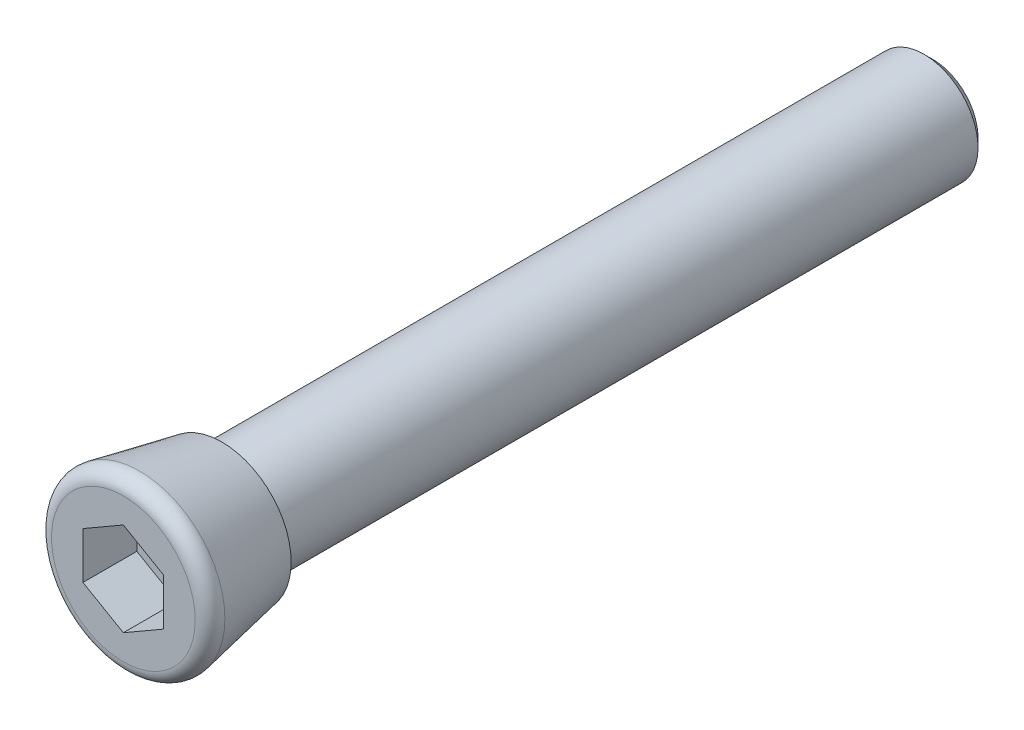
ISO-10303-21;
HEADER;
FILE_DESCRIPTION(('STEP AP214'),'2;1');
FILE_NAME('part.step','',(''),(''),'','','');
FILE_SCHEMA(('AUTOMOTIVE_DESIGN { 1 0 10303 214 1 1 1 1 }'));
ENDSEC;
DATA;
#1=APPLICATION_CONTEXT('core data for automotive mechanical design processes');
#2=APPLICATION_PROTOCOL_DEFINITION('international standard','automotive_design',2000,#1);
#3=PRODUCT_CONTEXT('',#1,'mechanical');
#4=PRODUCT('Part','Part','',(#3));
#5=PRODUCT_RELATED_PRODUCT_CATEGORY('part','',(#4));
#6=PRODUCT_DEFINITION_FORMATION('','',#4);
#7=PRODUCT_DEFINITION_CONTEXT('part definition',#1,'design');
#8=PRODUCT_DEFINITION('design','',#6,#7);
#9=PRODUCT_DEFINITION_SHAPE('','',#8);
#10=(LENGTH_UNIT() NAMED_UNIT(*) SI_UNIT(.MILLI.,.METRE.));
#11=(NAMED_UNIT(*) PLANE_ANGLE_UNIT() SI_UNIT($,.RADIAN.));
#12=(NAMED_UNIT(*) SI_UNIT($,.STERADIAN.) SOLID_ANGLE_UNIT());
#13=UNCERTAINTY_MEASURE_WITH_UNIT(LENGTH_MEASURE(1.E-05),#10,'distance_accuracy_value','');
#14=(GEOMETRIC_REPRESENTATION_CONTEXT(3) GLOBAL_UNCERTAINTY_ASSIGNED_CONTEXT((#13)) GLOBAL_UNIT_ASSIGNED_CONTEXT((#10,
#11,#12)) REPRESENTATION_CONTEXT('',''));
#15=CARTESIAN_POINT('',(0.,0.,0.));
#16=DIRECTION('',(0.,0.,1.));
#17=DIRECTION('',(1.,0.,0.));
#18=AXIS2_PLACEMENT_3D('',#15,#16,#17);
#19=CARTESIAN_POINT('',(-0.945872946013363,0.5461,-1.8288));
#20=DIRECTION('',(0.,0.,-1.));
#21=DIRECTION('',(-0.5,-0.866025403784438,0.));
#22=AXIS2_PLACEMENT_3D('',#19,#20,#21);
#23=PLANE('',#22);
#24=CARTESIAN_POINT('',(0.,0.,-1.8288));
#25=DIRECTION('',(0.,0.,-1.));
#26=DIRECTION('',(-0.5,-0.866025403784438,0.));
#27=AXIS2_PLACEMENT_3D('',#24,#25,#26);
#28=CIRCLE('',#27,1.28614392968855);
#29=CARTESIAN_POINT('',(-0.643071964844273,-1.11383331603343,-1.8288));
#30=VERTEX_POINT('',#29);
#31=EDGE_CURVE('E23',#30,#30,#28,.T.);
#32=ORIENTED_EDGE('',*,*,#31,.T.);
#33=EDGE_LOOP('',(#32));
#34=FACE_BOUND('',#33,.T.);
#35=CARTESIAN_POINT('',(0.,0.,-1.8288));
#36=DIRECTION('',(0.,0.,-1.));
#37=DIRECTION('',(-0.5,-0.866025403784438,0.));
#38=AXIS2_PLACEMENT_3D('',#35,#36,#37);
#39=CIRCLE('',#38,1.0922);
#40=CARTESIAN_POINT('',(-0.5461,-0.945872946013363,-1.8288));
#41=VERTEX_POINT('',#40);
#42=EDGE_CURVE('E130',#41,#41,#39,.T.);
#43=ORIENTED_EDGE('',*,*,#42,.F.);
#44=EDGE_LOOP('',(#43));
#45=FACE_BOUND('',#44,.T.);
#46=ADVANCED_FACE('F14',(#34,#45),#23,.T.);
#47=CARTESIAN_POINT('',(0.,0.,-1.8288));
#48=DIRECTION('',(0.,0.,1.));
#49=DIRECTION('',(0.5,0.866025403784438,0.));
#50=AXIS2_PLACEMENT_3D('',#47,#48,#49);
#51=CONICAL_SURFACE('',#50,1.28614392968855,0.191986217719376);
#52=CARTESIAN_POINT('',(0.,0.,-0.302465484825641));
#53=DIRECTION('',(0.,0.,-1.));
#54=DIRECTION('',(-0.5,-0.866025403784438,0.));
#55=AXIS2_PLACEMENT_3D('',#52,#53,#54);
#56=CIRCLE('',#55,1.5828333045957);
#57=CARTESIAN_POINT('',(-0.791416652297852,-1.37077385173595,-0.302465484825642));
#58=VERTEX_POINT('',#57);
#59=EDGE_CURVE('E136',#58,#58,#56,.T.);
#60=ORIENTED_EDGE('',*,*,#59,.T.);
#61=EDGE_LOOP('',(#60));
#62=FACE_BOUND('',#61,.T.);
#63=ORIENTED_EDGE('',*,*,#31,.F.);
#64=EDGE_LOOP('',(#63));
#65=FACE_BOUND('',#64,.T.);
#66=ADVANCED_FACE('F144',(#62,#65),#51,.T.);
#67=CARTESIAN_POINT('',(0.,0.,-0.254));
#68=DIRECTION('',(0.,0.,-1.));
#69=DIRECTION('',(-0.5,-0.866025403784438,0.));
#70=AXIS2_PLACEMENT_3D('',#67,#68,#69);
#71=TOROIDAL_SURFACE('',#70,1.3335,0.254);
#72=CARTESIAN_POINT('',(0.,0.,0.));
#73=DIRECTION('',(0.,0.,-1.));
#74=DIRECTION('',(-0.5,-0.866025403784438,0.));
#75=AXIS2_PLACEMENT_3D('',#72,#73,#74);
#76=CIRCLE('',#75,1.3335);
#77=CARTESIAN_POINT('',(-0.66675,-1.15484487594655,0.));
#78=VERTEX_POINT('',#77);
#79=EDGE_CURVE('E133',#78,#78,#76,.T.);
#80=ORIENTED_EDGE('',*,*,#79,.T.);
#81=EDGE_LOOP('',(#80));
#82=FACE_BOUND('',#81,.T.);
#83=ORIENTED_EDGE('',*,*,#59,.F.);
#84=EDGE_LOOP('',(#83));
#85=FACE_BOUND('',#84,.T.);
#86=ADVANCED_FACE('F146',(#82,#85),#71,.T.);
#87=CARTESIAN_POINT('',(-1.15484487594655,0.66675,0.));
#88=DIRECTION('',(0.,0.,1.));
#89=DIRECTION('',(0.5,0.866025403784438,0.));
#90=AXIS2_PLACEMENT_3D('',#87,#88,#89);
#91=PLANE('',#90);
#92=DIRECTION('',(0.86602540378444,0.5,0.));
#93=VECTOR('',#92,1.);
#94=CARTESIAN_POINT('',(0.,-0.866025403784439,0.));
#95=LINE('',#94,#93);
#96=CARTESIAN_POINT('',(0.,-0.866025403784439,0.));
#97=VERTEX_POINT('',#96);
#98=CARTESIAN_POINT('',(0.75,-0.433012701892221,0.));
#99=VERTEX_POINT('',#98);
#100=EDGE_CURVE('E30',#97,#99,#95,.T.);
#101=ORIENTED_EDGE('',*,*,#100,.F.);
#102=DIRECTION('',(0.866025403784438,-0.5,0.));
#103=VECTOR('',#102,1.);
#104=CARTESIAN_POINT('',(-0.75,-0.433012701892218,0.));
#105=LINE('',#104,#103);
#106=CARTESIAN_POINT('',(-0.75,-0.433012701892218,0.));
#107=VERTEX_POINT('',#106);
#108=EDGE_CURVE('E100',#107,#97,#105,.T.);
#109=ORIENTED_EDGE('',*,*,#108,.F.);
#110=DIRECTION('',(0.,-1.,0.));
#111=VECTOR('',#110,1.);
#112=CARTESIAN_POINT('',(-0.75,0.433012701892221,0.));
#113=LINE('',#112,#111);
#114=CARTESIAN_POINT('',(-0.75,0.433012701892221,0.));
#115=VERTEX_POINT('',#114);
#116=EDGE_CURVE('E94',#115,#107,#113,.T.);
#117=ORIENTED_EDGE('',*,*,#116,.F.);
#118=DIRECTION('',(-0.86602540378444,-0.5,0.));
#119=VECTOR('',#118,1.);
#120=CARTESIAN_POINT('',(0.,0.866025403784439,0.));
#121=LINE('',#120,#119);
#122=CARTESIAN_POINT('',(0.,0.866025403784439,0.));
#123=VERTEX_POINT('',#122);
#124=EDGE_CURVE('E92',#123,#115,#121,.T.);
#125=ORIENTED_EDGE('',*,*,#124,.F.);
#126=DIRECTION('',(-0.866025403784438,0.5,0.));
#127=VECTOR('',#126,1.);
#128=CARTESIAN_POINT('',(0.75,0.433012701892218,0.));
#129=LINE('',#128,#127);
#130=CARTESIAN_POINT('',(0.75,0.433012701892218,0.));
#131=VERTEX_POINT('',#130);
#132=EDGE_CURVE('E73',#131,#123,#129,.T.);
#133=ORIENTED_EDGE('',*,*,#132,.F.);
#134=DIRECTION('',(0.,1.,0.));
#135=VECTOR('',#134,1.);
#136=CARTESIAN_POINT('',(0.75,-0.433012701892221,0.));
#137=LINE('',#136,#135);
#138=EDGE_CURVE('E84',#99,#131,#137,.T.);
#139=ORIENTED_EDGE('',*,*,#138,.F.);
#140=EDGE_LOOP('',(#101,#109,#117,#125,#133,#139));
#141=FACE_BOUND('',#140,.T.);
#142=ORIENTED_EDGE('',*,*,#79,.F.);
#143=EDGE_LOOP('',(#142));
#144=FACE_BOUND('',#143,.T.);
#145=ADVANCED_FACE('F88',(#141,#144),#91,.T.);
#146=CARTESIAN_POINT('',(0.,0.,-1.82664));
#147=DIRECTION('',(0.,0.,-1.));
#148=DIRECTION('',(-0.5,-0.866025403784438,0.));
#149=AXIS2_PLACEMENT_3D('',#146,#147,#148);
#150=CYLINDRICAL_SURFACE('',#149,1.0922);
#151=ORIENTED_EDGE('',*,*,#42,.T.);
#152=EDGE_LOOP('',(#151));
#153=FACE_BOUND('',#152,.T.);
#154=CARTESIAN_POINT('',(0.,0.,-1.82664));
#155=DIRECTION('',(0.,0.,-1.));
#156=DIRECTION('',(-0.5,-0.866025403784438,0.));
#157=AXIS2_PLACEMENT_3D('',#154,#155,#156);
#158=CIRCLE('',#157,1.0922);
#159=CARTESIAN_POINT('',(-0.5461,-0.945872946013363,-1.82664));
#160=VERTEX_POINT('',#159);
#161=EDGE_CURVE('E127',#160,#160,#158,.T.);
#162=ORIENTED_EDGE('',*,*,#161,.F.);
#163=EDGE_LOOP('',(#162));
#164=FACE_BOUND('',#163,.T.);
#165=ADVANCED_FACE('F185',(#153,#164),#150,.F.);
#166=CARTESIAN_POINT('',(0.,0.,-1.82664));
#167=DIRECTION('',(0.,0.,-1.));
#168=DIRECTION('',(-0.5,-0.866025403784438,0.));
#169=AXIS2_PLACEMENT_3D('',#166,#167,#168);
#170=PLANE('',#169);
#171=CARTESIAN_POINT('',(0.,0.,-1.82664));
#172=DIRECTION('',(0.,0.,-1.));
#173=DIRECTION('',(-0.5,-0.866025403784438,0.));
#174=AXIS2_PLACEMENT_3D('',#171,#172,#173);
#175=CIRCLE('',#174,1.);
#176=CARTESIAN_POINT('',(-0.5,-0.866025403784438,-1.82664));
#177=VERTEX_POINT('',#176);
#178=EDGE_CURVE('E118',#177,#177,#175,.T.);
#179=ORIENTED_EDGE('',*,*,#178,.F.);
#180=EDGE_LOOP('',(#179));
#181=FACE_BOUND('',#180,.T.);
#182=ORIENTED_EDGE('',*,*,#161,.T.);
#183=EDGE_LOOP('',(#182));
#184=FACE_BOUND('',#183,.T.);
#185=ADVANCED_FACE('F179',(#181,#184),#170,.T.);
#186=CARTESIAN_POINT('',(0.,0.,-1.82664));
#187=DIRECTION('',(0.,0.,-1.));
#188=DIRECTION('',(-0.5,-0.866025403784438,0.));
#189=AXIS2_PLACEMENT_3D('',#186,#187,#188);
#190=CYLINDRICAL_SURFACE('',#189,1.);
#191=CARTESIAN_POINT('',(0.,0.,-14.86484));
#192=DIRECTION('',(0.,0.,1.));
#193=DIRECTION('',(0.5,0.866025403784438,0.));
#194=AXIS2_PLACEMENT_3D('',#191,#192,#193);
#195=CIRCLE('',#194,1.);
#196=CARTESIAN_POINT('',(0.5,0.866025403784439,-14.86484));
#197=VERTEX_POINT('',#196);
#198=EDGE_CURVE('E18',#197,#197,#195,.F.);
#199=ORIENTED_EDGE('',*,*,#198,.F.);
#200=EDGE_LOOP('',(#199));
#201=FACE_BOUND('',#200,.T.);
#202=ORIENTED_EDGE('',*,*,#178,.T.);
#203=EDGE_LOOP('',(#202));
#204=FACE_BOUND('',#203,.T.);
#205=ADVANCED_FACE('F170',(#201,#204),#190,.T.);
#206=CARTESIAN_POINT('',(0.,0.,-15.02664));
#207=DIRECTION('',(0.,0.,-1.));
#208=DIRECTION('',(-0.5,-0.866025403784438,0.));
#209=AXIS2_PLACEMENT_3D('',#206,#207,#208);
#210=PLANE('',#209);
#211=CARTESIAN_POINT('',(0.,0.,-15.02664));
#212=DIRECTION('',(0.,0.,-1.));
#213=DIRECTION('',(-0.5,-0.866025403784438,0.));
#214=AXIS2_PLACEMENT_3D('',#211,#212,#213);
#215=CIRCLE('',#214,0.8382);
#216=CARTESIAN_POINT('',(-0.4191,-0.725902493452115,-15.02664));
#217=VERTEX_POINT('',#216);
#218=EDGE_CURVE('E9',#217,#217,#215,.T.);
#219=ORIENTED_EDGE('',*,*,#218,.T.);
#220=EDGE_LOOP('',(#219));
#221=FACE_BOUND('',#220,.T.);
#222=ADVANCED_FACE('F16',(#221),#210,.T.);
#223=CARTESIAN_POINT('',(0.,0.,-15.02664));
#224=DIRECTION('',(0.,0.,1.));
#225=DIRECTION('',(0.5,0.866025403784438,0.));
#226=AXIS2_PLACEMENT_3D('',#223,#224,#225);
#227=CONICAL_SURFACE('',#226,0.8382,0.785398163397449);
#228=ORIENTED_EDGE('',*,*,#218,.F.);
#229=EDGE_LOOP('',(#228));
#230=FACE_BOUND('',#229,.T.);
#231=ORIENTED_EDGE('',*,*,#198,.T.);
#232=EDGE_LOOP('',(#231));
#233=FACE_BOUND('',#232,.T.);
#234=ADVANCED_FACE('F159',(#230,#233),#227,.T.);
#235=CARTESIAN_POINT('',(0.,-0.866025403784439,-1.));
#236=DIRECTION('',(0.5,-0.86602540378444,0.));
#237=DIRECTION('',(0.86602540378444,0.5,0.));
#238=AXIS2_PLACEMENT_3D('',#235,#236,#237);
#239=PLANE('',#238);
#240=ORIENTED_EDGE('',*,*,#100,.T.);
#241=DIRECTION('',(0.,0.,1.));
#242=VECTOR('',#241,1.);
#243=CARTESIAN_POINT('',(0.75,-0.433012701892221,-1.));
#244=LINE('',#243,#242);
#245=CARTESIAN_POINT('',(0.75,-0.433012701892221,-1.));
#246=VERTEX_POINT('',#245);
#247=EDGE_CURVE('E81',#246,#99,#244,.T.);
#248=ORIENTED_EDGE('',*,*,#247,.F.);
#249=DIRECTION('',(0.86602540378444,0.5,0.));
#250=VECTOR('',#249,1.);
#251=CARTESIAN_POINT('',(0.,-0.866025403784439,-1.));
#252=LINE('',#251,#250);
#253=CARTESIAN_POINT('',(0.,-0.866025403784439,-1.));
#254=VERTEX_POINT('',#253);
#255=EDGE_CURVE('E102',#254,#246,#252,.T.);
#256=ORIENTED_EDGE('',*,*,#255,.F.);
#257=DIRECTION('',(0.,0.,1.));
#258=VECTOR('',#257,1.);
#259=CARTESIAN_POINT('',(0.,-0.866025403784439,-1.));
#260=LINE('',#259,#258);
#261=EDGE_CURVE('E37',#254,#97,#260,.T.);
#262=ORIENTED_EDGE('',*,*,#261,.T.);
#263=EDGE_LOOP('',(#240,#248,#256,#262));
#264=FACE_BOUND('',#263,.T.);
#265=ADVANCED_FACE('F161',(#264),#239,.F.);
#266=CARTESIAN_POINT('',(-0.75,-0.433012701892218,-1.));
#267=DIRECTION('',(-0.5,-0.866025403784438,0.));
#268=DIRECTION('',(0.866025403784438,-0.5,0.));
#269=AXIS2_PLACEMENT_3D('',#266,#267,#268);
#270=PLANE('',#269);
#271=ORIENTED_EDGE('',*,*,#108,.T.);
#272=ORIENTED_EDGE('',*,*,#261,.F.);
#273=DIRECTION('',(0.866025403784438,-0.5,0.));
#274=VECTOR('',#273,1.);
#275=CARTESIAN_POINT('',(-0.75,-0.433012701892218,-1.));
#276=LINE('',#275,#274);
#277=CARTESIAN_POINT('',(-0.75,-0.433012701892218,-1.));
#278=VERTEX_POINT('',#277);
#279=EDGE_CURVE('E114',#278,#254,#276,.T.);
#280=ORIENTED_EDGE('',*,*,#279,.F.);
#281=DIRECTION('',(0.,0.,1.));
#282=VECTOR('',#281,1.);
#283=CARTESIAN_POINT('',(-0.75,-0.433012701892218,-1.));
#284=LINE('',#283,#282);
#285=EDGE_CURVE('E119',#278,#107,#284,.T.);
#286=ORIENTED_EDGE('',*,*,#285,.T.);
#287=EDGE_LOOP('',(#271,#272,#280,#286));
#288=FACE_BOUND('',#287,.T.);
#289=ADVANCED_FACE('F168',(#288),#270,.F.);
#290=CARTESIAN_POINT('',(-0.75,0.433012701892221,-1.));
#291=DIRECTION('',(-1.,0.,0.));
#292=DIRECTION('',(0.,-1.,0.));
#293=AXIS2_PLACEMENT_3D('',#290,#291,#292);
#294=PLANE('',#293);
#295=ORIENTED_EDGE('',*,*,#116,.T.);
#296=ORIENTED_EDGE('',*,*,#285,.F.);
#297=DIRECTION('',(0.,-1.,0.));
#298=VECTOR('',#297,1.);
#299=CARTESIAN_POINT('',(-0.75,0.433012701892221,-1.));
#300=LINE('',#299,#298);
#301=CARTESIAN_POINT('',(-0.75,0.433012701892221,-1.));
#302=VERTEX_POINT('',#301);
#303=EDGE_CURVE('E111',#302,#278,#300,.T.);
#304=ORIENTED_EDGE('',*,*,#303,.F.);
#305=DIRECTION('',(0.,0.,1.));
#306=VECTOR('',#305,1.);
#307=CARTESIAN_POINT('',(-0.75,0.433012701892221,-1.));
#308=LINE('',#307,#306);
#309=EDGE_CURVE('E121',#302,#115,#308,.T.);
#310=ORIENTED_EDGE('',*,*,#309,.T.);
#311=EDGE_LOOP('',(#295,#296,#304,#310));
#312=FACE_BOUND('',#311,.T.);
#313=ADVANCED_FACE('F205',(#312),#294,.F.);
#314=CARTESIAN_POINT('',(0.,0.866025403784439,-1.));
#315=DIRECTION('',(-0.5,0.86602540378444,0.));
#316=DIRECTION('',(-0.86602540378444,-0.5,0.));
#317=AXIS2_PLACEMENT_3D('',#314,#315,#316);
#318=PLANE('',#317);
#319=ORIENTED_EDGE('',*,*,#124,.T.);
#320=ORIENTED_EDGE('',*,*,#309,.F.);
#321=DIRECTION('',(-0.86602540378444,-0.5,0.));
#322=VECTOR('',#321,1.);
#323=CARTESIAN_POINT('',(0.,0.866025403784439,-1.));
#324=LINE('',#323,#322);
#325=CARTESIAN_POINT('',(0.,0.866025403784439,-1.));
#326=VERTEX_POINT('',#325);
#327=EDGE_CURVE('E108',#326,#302,#324,.T.);
#328=ORIENTED_EDGE('',*,*,#327,.F.);
#329=DIRECTION('',(0.,0.,1.));
#330=VECTOR('',#329,1.);
#331=CARTESIAN_POINT('',(0.,0.866025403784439,-1.));
#332=LINE('',#331,#330);
#333=EDGE_CURVE('E80',#326,#123,#332,.T.);
#334=ORIENTED_EDGE('',*,*,#333,.T.);
#335=EDGE_LOOP('',(#319,#320,#328,#334));
#336=FACE_BOUND('',#335,.T.);
#337=ADVANCED_FACE('F202',(#336),#318,.F.);
#338=CARTESIAN_POINT('',(0.75,0.433012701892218,-1.));
#339=DIRECTION('',(0.5,0.866025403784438,0.));
#340=DIRECTION('',(-0.866025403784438,0.5,0.));
#341=AXIS2_PLACEMENT_3D('',#338,#339,#340);
#342=PLANE('',#341);
#343=ORIENTED_EDGE('',*,*,#132,.T.);
#344=ORIENTED_EDGE('',*,*,#333,.F.);
#345=DIRECTION('',(-0.866025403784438,0.5,0.));
#346=VECTOR('',#345,1.);
#347=CARTESIAN_POINT('',(0.75,0.433012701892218,-1.));
#348=LINE('',#347,#346);
#349=CARTESIAN_POINT('',(0.75,0.433012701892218,-1.));
#350=VERTEX_POINT('',#349);
#351=EDGE_CURVE('E76',#350,#326,#348,.T.);
#352=ORIENTED_EDGE('',*,*,#351,.F.);
#353=DIRECTION('',(0.,0.,1.));
#354=VECTOR('',#353,1.);
#355=CARTESIAN_POINT('',(0.75,0.433012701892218,-1.));
#356=LINE('',#355,#354);
#357=EDGE_CURVE('E69',#350,#131,#356,.T.);
#358=ORIENTED_EDGE('',*,*,#357,.T.);
#359=EDGE_LOOP('',(#343,#344,#352,#358));
#360=FACE_BOUND('',#359,.T.);
#361=ADVANCED_FACE('F71',(#360),#342,.F.);
#362=CARTESIAN_POINT('',(0.75,-0.433012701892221,-1.));
#363=DIRECTION('',(1.,0.,0.));
#364=DIRECTION('',(0.,1.,0.));
#365=AXIS2_PLACEMENT_3D('',#362,#363,#364);
#366=PLANE('',#365);
#367=ORIENTED_EDGE('',*,*,#138,.T.);
#368=ORIENTED_EDGE('',*,*,#357,.F.);
#369=DIRECTION('',(0.,1.,0.));
#370=VECTOR('',#369,1.);
#371=CARTESIAN_POINT('',(0.75,-0.433012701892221,-1.));
#372=LINE('',#371,#370);
#373=EDGE_CURVE('E105',#246,#350,#372,.T.);
#374=ORIENTED_EDGE('',*,*,#373,.F.);
#375=ORIENTED_EDGE('',*,*,#247,.T.);
#376=EDGE_LOOP('',(#367,#368,#374,#375));
#377=FACE_BOUND('',#376,.T.);
#378=ADVANCED_FACE('F85',(#377),#366,.F.);
#379=CARTESIAN_POINT('',(0.,-0.866025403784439,-1.));
#380=DIRECTION('',(0.,0.,-1.));
#381=DIRECTION('',(-0.5,-0.866025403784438,0.));
#382=AXIS2_PLACEMENT_3D('',#379,#380,#381);
#383=PLANE('',#382);
#384=ORIENTED_EDGE('',*,*,#255,.T.);
#385=ORIENTED_EDGE('',*,*,#373,.T.);
#386=ORIENTED_EDGE('',*,*,#351,.T.);
#387=ORIENTED_EDGE('',*,*,#327,.T.);
#388=ORIENTED_EDGE('',*,*,#303,.T.);
#389=ORIENTED_EDGE('',*,*,#279,.T.);
#390=EDGE_LOOP('',(#384,#385,#386,#387,#388,#389));
#391=FACE_BOUND('',#390,.T.);
#392=ADVANCED_FACE('F199',(#391),#383,.F.);
#393=CLOSED_SHELL('',(#46,#66,#86,#145,#165,#185,#205,#222,#234,#265,#289,#313,#337,#361,#378,#392));
#394=MANIFOLD_SOLID_BREP('B1',#393);
#395=ADVANCED_BREP_SHAPE_REPRESENTATION('',(#18,#394),#14);
#396=SHAPE_DEFINITION_REPRESENTATION(#9,#395);
ENDSEC;
END-ISO-10303-21;
